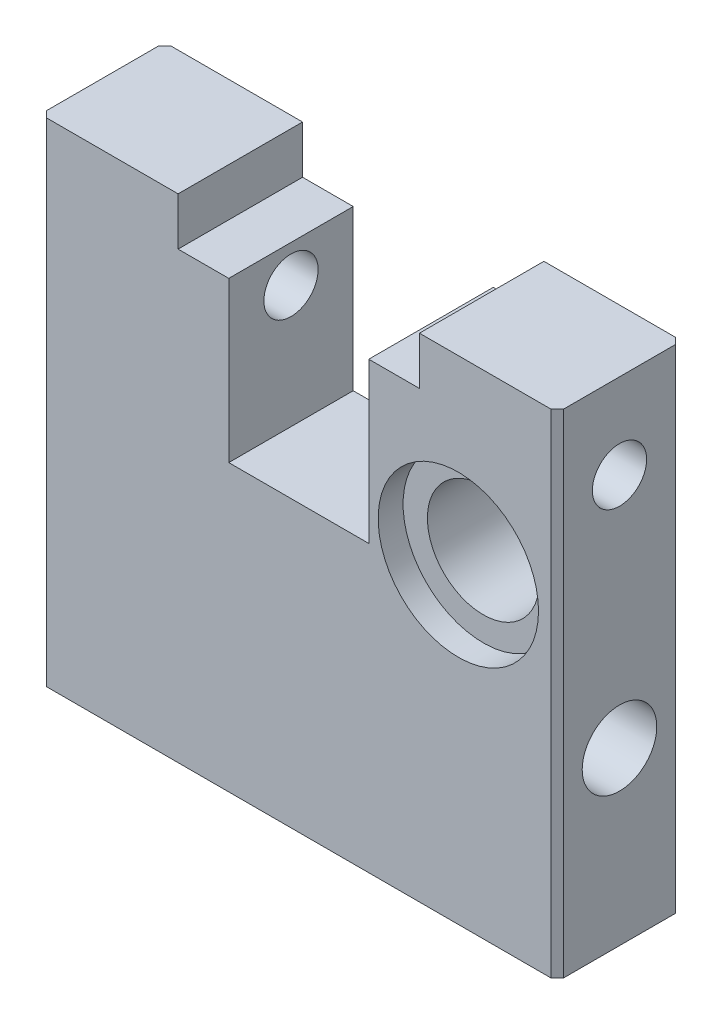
from build123d import *

# Parameters (mm, degrees)
SKETCH_1_R          = 3.556
EXTRUDE_1_DEPTH     = 7.9248
SKETCH_2_R          = 5.1054
CUT_EXTRUDE_1_DEPTH = 1.5875
SKETCH_3_R          = 1.7272
SKETCH_3_R_2        = 2.3749
CUT_EXTRUDE_2_DEPTH = 47.156664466
SKETCH_4_R          = 3.2004
CUT_EXTRUDE_3_DEPTH = 7.14375
CHAMFER_1_SIZE      = 0.396875


with BuildPart() as part:
    # Sketch 1 → Extrude 1 (new body)
    with BuildSketch(Plane.XY):
        Polygon((7.6835, 31.369), (16.4592, 31.369), (16.4592, 0), (-16.4592, 0), (-16.4592, 31.369), (-7.6835, 31.369), (-7.6835, 28.321), (-4.4577, 28.321), (-4.4577, 18.161), (4.4577, 18.161), (4.4577, 28.321), (7.6835, 28.321), align=None)
        with Locations((10.16, 19.83994)):
            Circle(SKETCH_1_R, mode=Mode.SUBTRACT)
    extrude(amount=EXTRUDE_1_DEPTH)

    # Sketch 2 → Cut-Extrude 1 (cut)
    with BuildSketch(Plane.XY.offset(7.9248)):
        with Locations((10.16, 19.83994)):
            Circle(SKETCH_2_R)
    extrude(amount=-CUT_EXTRUDE_1_DEPTH, mode=Mode.SUBTRACT)

    # Sketch 3 → Cut-Extrude 2 (cut, through all)
    with BuildSketch(Plane.ZY.offset(16.4592)):
        with Locations((3.9624, 25.9588)):
            Circle(SKETCH_3_R)
        with Locations((3.9624, 10.8966)):
            Circle(SKETCH_3_R_2)
    extrude(amount=-CUT_EXTRUDE_2_DEPTH, mode=Mode.SUBTRACT)

    # Sketch 4 → Cut-Extrude 3 (cut)
    with BuildSketch(Plane.ZY.offset(16.4592)):
        with Locations((3.9624, 25.9588)):
            Circle(SKETCH_4_R)
    extrude(amount=-CUT_EXTRUDE_3_DEPTH, mode=Mode.SUBTRACT)

    # Chamfer 1
    chamfer_1_edges = [part.edges().sort_by_distance(p)[0] for p in [
        (16.4592, 15.6845, 7.9248),
        (16.4592, 15.6845, 0),
        (-16.4592, 15.6845, 0),
        (-16.4592, 15.6845, 7.9248),
    ]]
    chamfer(chamfer_1_edges, length=CHAMFER_1_SIZE)


solid = part.part
